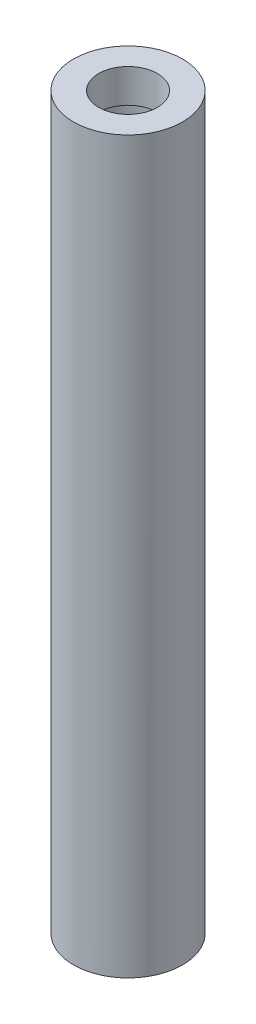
ISO-10303-21;
HEADER;
FILE_DESCRIPTION(('STEP AP214'),'2;1');
FILE_NAME('part.step','',(''),(''),'','','');
FILE_SCHEMA(('AUTOMOTIVE_DESIGN { 1 0 10303 214 1 1 1 1 }'));
ENDSEC;
DATA;
#1=APPLICATION_CONTEXT('core data for automotive mechanical design processes');
#2=APPLICATION_PROTOCOL_DEFINITION('international standard','automotive_design',2000,#1);
#3=PRODUCT_CONTEXT('',#1,'mechanical');
#4=PRODUCT('Part','Part','',(#3));
#5=PRODUCT_RELATED_PRODUCT_CATEGORY('part','',(#4));
#6=PRODUCT_DEFINITION_FORMATION('','',#4);
#7=PRODUCT_DEFINITION_CONTEXT('part definition',#1,'design');
#8=PRODUCT_DEFINITION('design','',#6,#7);
#9=PRODUCT_DEFINITION_SHAPE('','',#8);
#10=(LENGTH_UNIT() NAMED_UNIT(*) SI_UNIT(.MILLI.,.METRE.));
#11=(NAMED_UNIT(*) PLANE_ANGLE_UNIT() SI_UNIT($,.RADIAN.));
#12=(NAMED_UNIT(*) SI_UNIT($,.STERADIAN.) SOLID_ANGLE_UNIT());
#13=UNCERTAINTY_MEASURE_WITH_UNIT(LENGTH_MEASURE(1.E-05),#10,'distance_accuracy_value','');
#14=(GEOMETRIC_REPRESENTATION_CONTEXT(3) GLOBAL_UNCERTAINTY_ASSIGNED_CONTEXT((#13)) GLOBAL_UNIT_ASSIGNED_CONTEXT((#10,
#11,#12)) REPRESENTATION_CONTEXT('',''));
#15=CARTESIAN_POINT('',(0.,0.,0.));
#16=DIRECTION('',(0.,0.,1.));
#17=DIRECTION('',(1.,0.,0.));
#18=AXIS2_PLACEMENT_3D('',#15,#16,#17);
#19=CARTESIAN_POINT('',(0.,39.5,0.));
#20=DIRECTION('',(0.,-1.,0.));
#21=DIRECTION('',(0.,0.,-1.));
#22=AXIS2_PLACEMENT_3D('',#19,#20,#21);
#23=CYLINDRICAL_SURFACE('',#22,3.25);
#24=CARTESIAN_POINT('',(0.,-2.,0.));
#25=DIRECTION('',(0.,-1.,0.));
#26=DIRECTION('',(0.,0.,-1.));
#27=AXIS2_PLACEMENT_3D('',#24,#25,#26);
#28=CIRCLE('',#27,3.25);
#29=CARTESIAN_POINT('',(0.,-2.,-3.25));
#30=VERTEX_POINT('',#29);
#31=EDGE_CURVE('E39',#30,#30,#28,.T.);
#32=ORIENTED_EDGE('',*,*,#31,.F.);
#33=EDGE_LOOP('',(#32));
#34=FACE_BOUND('',#33,.T.);
#35=CARTESIAN_POINT('',(0.,41.5,0.));
#36=DIRECTION('',(0.,1.,0.));
#37=DIRECTION('',(0.,0.,1.));
#38=AXIS2_PLACEMENT_3D('',#35,#36,#37);
#39=CIRCLE('',#38,3.25);
#40=CARTESIAN_POINT('',(0.,41.5,3.25));
#41=VERTEX_POINT('',#40);
#42=EDGE_CURVE('E53',#41,#41,#39,.T.);
#43=ORIENTED_EDGE('',*,*,#42,.F.);
#44=EDGE_LOOP('',(#43));
#45=FACE_BOUND('',#44,.T.);
#46=ADVANCED_FACE('F33',(#34,#45),#23,.T.);
#47=CARTESIAN_POINT('',(0.,-13.5,0.));
#48=DIRECTION('',(0.,1.,0.));
#49=DIRECTION('',(0.,0.,1.));
#50=AXIS2_PLACEMENT_3D('',#47,#48,#49);
#51=CYLINDRICAL_SURFACE('',#50,2.25);
#52=CARTESIAN_POINT('',(0.,39.5,0.));
#53=DIRECTION('',(0.,1.,0.));
#54=DIRECTION('',(0.,0.,1.));
#55=AXIS2_PLACEMENT_3D('',#52,#53,#54);
#56=CIRCLE('',#55,2.25);
#57=CARTESIAN_POINT('',(0.,39.5,2.25));
#58=VERTEX_POINT('',#57);
#59=EDGE_CURVE('E51',#58,#58,#56,.T.);
#60=ORIENTED_EDGE('',*,*,#59,.T.);
#61=EDGE_LOOP('',(#60));
#62=FACE_BOUND('',#61,.T.);
#63=CARTESIAN_POINT('',(0.,0.,0.));
#64=DIRECTION('',(0.,1.,0.));
#65=DIRECTION('',(0.,0.,1.));
#66=AXIS2_PLACEMENT_3D('',#63,#64,#65);
#67=CIRCLE('',#66,2.25);
#68=CARTESIAN_POINT('',(0.,0.,2.25));
#69=VERTEX_POINT('',#68);
#70=EDGE_CURVE('E10',#69,#69,#67,.T.);
#71=ORIENTED_EDGE('',*,*,#70,.F.);
#72=EDGE_LOOP('',(#71));
#73=FACE_BOUND('',#72,.T.);
#74=ADVANCED_FACE('F82',(#62,#73),#51,.F.);
#75=CARTESIAN_POINT('',(0.,0.,0.));
#76=DIRECTION('',(0.,-1.,0.));
#77=DIRECTION('',(0.,0.,-1.));
#78=AXIS2_PLACEMENT_3D('',#75,#76,#77);
#79=PLANE('',#78);
#80=CARTESIAN_POINT('',(0.,0.,0.));
#81=DIRECTION('',(0.,-1.,0.));
#82=DIRECTION('',(0.,0.,-1.));
#83=AXIS2_PLACEMENT_3D('',#80,#81,#82);
#84=CIRCLE('',#83,1.75);
#85=CARTESIAN_POINT('',(0.,0.,-1.75));
#86=VERTEX_POINT('',#85);
#87=EDGE_CURVE('E48',#86,#86,#84,.T.);
#88=ORIENTED_EDGE('',*,*,#87,.T.);
#89=EDGE_LOOP('',(#88));
#90=FACE_BOUND('',#89,.T.);
#91=ORIENTED_EDGE('',*,*,#70,.T.);
#92=EDGE_LOOP('',(#91));
#93=FACE_BOUND('',#92,.T.);
#94=ADVANCED_FACE('F87',(#90,#93),#79,.F.);
#95=CARTESIAN_POINT('',(0.,-2.,0.));
#96=DIRECTION('',(0.,-1.,0.));
#97=DIRECTION('',(0.,0.,-1.));
#98=AXIS2_PLACEMENT_3D('',#95,#96,#97);
#99=PLANE('',#98);
#100=ORIENTED_EDGE('',*,*,#31,.T.);
#101=EDGE_LOOP('',(#100));
#102=FACE_BOUND('',#101,.T.);
#103=CARTESIAN_POINT('',(0.,-2.,0.));
#104=DIRECTION('',(0.,-1.,0.));
#105=DIRECTION('',(0.,0.,-1.));
#106=AXIS2_PLACEMENT_3D('',#103,#104,#105);
#107=CIRCLE('',#106,1.75);
#108=CARTESIAN_POINT('',(0.,-2.,-1.75));
#109=VERTEX_POINT('',#108);
#110=EDGE_CURVE('E43',#109,#109,#107,.T.);
#111=ORIENTED_EDGE('',*,*,#110,.F.);
#112=EDGE_LOOP('',(#111));
#113=FACE_BOUND('',#112,.T.);
#114=ADVANCED_FACE('F92',(#102,#113),#99,.T.);
#115=CARTESIAN_POINT('',(0.,-2.,0.));
#116=DIRECTION('',(0.,1.,0.));
#117=DIRECTION('',(0.,0.,1.));
#118=AXIS2_PLACEMENT_3D('',#115,#116,#117);
#119=CYLINDRICAL_SURFACE('',#118,1.75);
#120=ORIENTED_EDGE('',*,*,#110,.T.);
#121=EDGE_LOOP('',(#120));
#122=FACE_BOUND('',#121,.T.);
#123=ORIENTED_EDGE('',*,*,#87,.F.);
#124=EDGE_LOOP('',(#123));
#125=FACE_BOUND('',#124,.T.);
#126=ADVANCED_FACE('F99',(#122,#125),#119,.F.);
#127=CARTESIAN_POINT('',(0.,39.5,0.));
#128=DIRECTION('',(0.,1.,0.));
#129=DIRECTION('',(0.,0.,1.));
#130=AXIS2_PLACEMENT_3D('',#127,#128,#129);
#131=PLANE('',#130);
#132=CARTESIAN_POINT('',(0.,39.5,0.));
#133=DIRECTION('',(0.,1.,0.));
#134=DIRECTION('',(0.,0.,1.));
#135=AXIS2_PLACEMENT_3D('',#132,#133,#134);
#136=CIRCLE('',#135,1.75);
#137=CARTESIAN_POINT('',(0.,39.5,1.75));
#138=VERTEX_POINT('',#137);
#139=EDGE_CURVE('E63',#138,#138,#136,.T.);
#140=ORIENTED_EDGE('',*,*,#139,.T.);
#141=EDGE_LOOP('',(#140));
#142=FACE_BOUND('',#141,.T.);
#143=ORIENTED_EDGE('',*,*,#59,.F.);
#144=EDGE_LOOP('',(#143));
#145=FACE_BOUND('',#144,.T.);
#146=ADVANCED_FACE('F69',(#142,#145),#131,.F.);
#147=CARTESIAN_POINT('',(0.,41.5,0.));
#148=DIRECTION('',(0.,1.,0.));
#149=DIRECTION('',(0.,0.,1.));
#150=AXIS2_PLACEMENT_3D('',#147,#148,#149);
#151=PLANE('',#150);
#152=ORIENTED_EDGE('',*,*,#42,.T.);
#153=EDGE_LOOP('',(#152));
#154=FACE_BOUND('',#153,.T.);
#155=CARTESIAN_POINT('',(0.,41.5,0.));
#156=DIRECTION('',(0.,1.,0.));
#157=DIRECTION('',(0.,0.,1.));
#158=AXIS2_PLACEMENT_3D('',#155,#156,#157);
#159=CIRCLE('',#158,1.75);
#160=CARTESIAN_POINT('',(0.,41.5,1.75));
#161=VERTEX_POINT('',#160);
#162=EDGE_CURVE('E58',#161,#161,#159,.T.);
#163=ORIENTED_EDGE('',*,*,#162,.F.);
#164=EDGE_LOOP('',(#163));
#165=FACE_BOUND('',#164,.T.);
#166=ADVANCED_FACE('F74',(#154,#165),#151,.T.);
#167=CARTESIAN_POINT('',(0.,41.5,0.));
#168=DIRECTION('',(0.,-1.,0.));
#169=DIRECTION('',(0.,0.,-1.));
#170=AXIS2_PLACEMENT_3D('',#167,#168,#169);
#171=CYLINDRICAL_SURFACE('',#170,1.75);
#172=ORIENTED_EDGE('',*,*,#162,.T.);
#173=EDGE_LOOP('',(#172));
#174=FACE_BOUND('',#173,.T.);
#175=ORIENTED_EDGE('',*,*,#139,.F.);
#176=EDGE_LOOP('',(#175));
#177=FACE_BOUND('',#176,.T.);
#178=ADVANCED_FACE('F72',(#174,#177),#171,.F.);
#179=CLOSED_SHELL('',(#46,#74,#94,#114,#126,#146,#166,#178));
#180=MANIFOLD_SOLID_BREP('B2',#179);
#181=ADVANCED_BREP_SHAPE_REPRESENTATION('',(#18,#180),#14);
#182=SHAPE_DEFINITION_REPRESENTATION(#9,#181);
ENDSEC;
END-ISO-10303-21;
